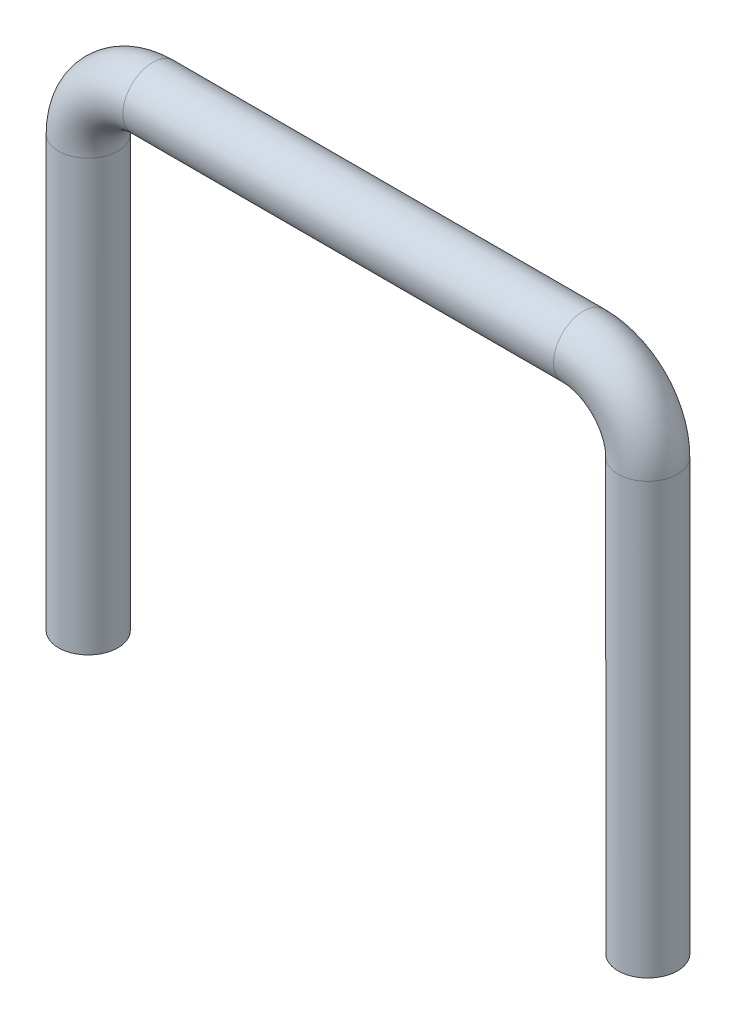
ISO-10303-21;
HEADER;
FILE_DESCRIPTION(('STEP AP214'),'2;1');
FILE_NAME('part.step','',(''),(''),'','','');
FILE_SCHEMA(('AUTOMOTIVE_DESIGN { 1 0 10303 214 1 1 1 1 }'));
ENDSEC;
DATA;
#1=APPLICATION_CONTEXT('core data for automotive mechanical design processes');
#2=APPLICATION_PROTOCOL_DEFINITION('international standard','automotive_design',2000,#1);
#3=PRODUCT_CONTEXT('',#1,'mechanical');
#4=PRODUCT('Part','Part','',(#3));
#5=PRODUCT_RELATED_PRODUCT_CATEGORY('part','',(#4));
#6=PRODUCT_DEFINITION_FORMATION('','',#4);
#7=PRODUCT_DEFINITION_CONTEXT('part definition',#1,'design');
#8=PRODUCT_DEFINITION('design','',#6,#7);
#9=PRODUCT_DEFINITION_SHAPE('','',#8);
#10=(LENGTH_UNIT() NAMED_UNIT(*) SI_UNIT(.MILLI.,.METRE.));
#11=(NAMED_UNIT(*) PLANE_ANGLE_UNIT() SI_UNIT($,.RADIAN.));
#12=(NAMED_UNIT(*) SI_UNIT($,.STERADIAN.) SOLID_ANGLE_UNIT());
#13=UNCERTAINTY_MEASURE_WITH_UNIT(LENGTH_MEASURE(1.E-05),#10,'distance_accuracy_value','');
#14=(GEOMETRIC_REPRESENTATION_CONTEXT(3) GLOBAL_UNCERTAINTY_ASSIGNED_CONTEXT((#13)) GLOBAL_UNIT_ASSIGNED_CONTEXT((#10,
#11,#12)) REPRESENTATION_CONTEXT('',''));
#15=CARTESIAN_POINT('',(0.,0.,0.));
#16=DIRECTION('',(0.,0.,1.));
#17=DIRECTION('',(1.,0.,0.));
#18=AXIS2_PLACEMENT_3D('',#15,#16,#17);
#19=CARTESIAN_POINT('',(564.55,434.,0.));
#20=DIRECTION('',(0.,-1.,0.));
#21=DIRECTION('',(1.,0.,0.));
#22=AXIS2_PLACEMENT_3D('',#19,#20,#21);
#23=CYLINDRICAL_SURFACE('',#22,30.);
#24=CARTESIAN_POINT('',(564.55,434.,0.));
#25=DIRECTION('',(0.,-1.,0.));
#26=DIRECTION('',(0.,0.,1.));
#27=AXIS2_PLACEMENT_3D('',#24,#25,#26);
#28=CIRCLE('',#27,30.);
#29=CARTESIAN_POINT('',(594.55,434.,0.));
#30=VERTEX_POINT('',#29);
#31=EDGE_CURVE('E40',#30,#30,#28,.T.);
#32=ORIENTED_EDGE('',*,*,#31,.T.);
#33=EDGE_LOOP('',(#32));
#34=FACE_BOUND('',#33,.T.);
#35=CARTESIAN_POINT('',(564.55,0.,0.));
#36=DIRECTION('',(0.,-1.,0.));
#37=DIRECTION('',(0.,0.,1.));
#38=AXIS2_PLACEMENT_3D('',#35,#36,#37);
#39=CIRCLE('',#38,30.);
#40=CARTESIAN_POINT('',(564.55,0.,30.));
#41=VERTEX_POINT('',#40);
#42=EDGE_CURVE('E10',#41,#41,#39,.T.);
#43=ORIENTED_EDGE('',*,*,#42,.F.);
#44=EDGE_LOOP('',(#43));
#45=FACE_BOUND('',#44,.T.);
#46=ADVANCED_FACE('F30',(#34,#45),#23,.T.);
#47=CARTESIAN_POINT('',(564.55,434.,0.));
#48=DIRECTION('',(0.,-1.,0.));
#49=DIRECTION('',(1.,0.,0.));
#50=AXIS2_PLACEMENT_3D('',#47,#48,#49);
#51=CYLINDRICAL_SURFACE('',#50,8.);
#52=CARTESIAN_POINT('',(564.55,434.,0.));
#53=DIRECTION('',(0.,-1.,0.));
#54=DIRECTION('',(0.,0.,1.));
#55=AXIS2_PLACEMENT_3D('',#52,#53,#54);
#56=CIRCLE('',#55,8.);
#57=CARTESIAN_POINT('',(572.55,434.,0.));
#58=VERTEX_POINT('',#57);
#59=EDGE_CURVE('E44',#58,#58,#56,.T.);
#60=ORIENTED_EDGE('',*,*,#59,.F.);
#61=EDGE_LOOP('',(#60));
#62=FACE_BOUND('',#61,.T.);
#63=CARTESIAN_POINT('',(564.55,0.,0.));
#64=DIRECTION('',(0.,-1.,0.));
#65=DIRECTION('',(0.,0.,1.));
#66=AXIS2_PLACEMENT_3D('',#63,#64,#65);
#67=CIRCLE('',#66,8.);
#68=CARTESIAN_POINT('',(564.55,0.,8.));
#69=VERTEX_POINT('',#68);
#70=EDGE_CURVE('E36',#69,#69,#67,.T.);
#71=ORIENTED_EDGE('',*,*,#70,.T.);
#72=EDGE_LOOP('',(#71));
#73=FACE_BOUND('',#72,.T.);
#74=ADVANCED_FACE('F94',(#62,#73),#51,.F.);
#75=CARTESIAN_POINT('',(499.55,434.,0.));
#76=DIRECTION('',(0.,0.,-1.));
#77=DIRECTION('',(-1.,0.,0.));
#78=AXIS2_PLACEMENT_3D('',#75,#76,#77);
#79=TOROIDAL_SURFACE('',#78,64.9999999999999,30.);
#80=CARTESIAN_POINT('',(499.55,499.,0.));
#81=DIRECTION('',(1.,0.,0.));
#82=DIRECTION('',(0.,0.,1.));
#83=AXIS2_PLACEMENT_3D('',#80,#81,#82);
#84=CIRCLE('',#83,30.);
#85=CARTESIAN_POINT('',(499.55,529.,0.));
#86=VERTEX_POINT('',#85);
#87=EDGE_CURVE('E49',#86,#86,#84,.T.);
#88=CARTESIAN_POINT('',(499.55,434.,0.));
#89=DIRECTION('',(0.,0.,-1.));
#90=DIRECTION('',(-1.,0.,0.));
#91=AXIS2_PLACEMENT_3D('',#88,#89,#90);
#92=CIRCLE('',#91,94.9999999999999);
#93=EDGE_CURVE('',#86,#30,#92,.T.);
#94=ORIENTED_EDGE('',*,*,#87,.T.);
#95=ORIENTED_EDGE('',*,*,#31,.F.);
#96=ORIENTED_EDGE('',*,*,#93,.T.);
#97=ORIENTED_EDGE('',*,*,#93,.F.);
#98=EDGE_LOOP('',(#94,#96,#95,#97));
#99=FACE_BOUND('',#98,.T.);
#100=ADVANCED_FACE('F99',(#99),#79,.T.);
#101=CARTESIAN_POINT('',(499.55,434.,0.));
#102=DIRECTION('',(0.,0.,-1.));
#103=DIRECTION('',(-1.,0.,0.));
#104=AXIS2_PLACEMENT_3D('',#101,#102,#103);
#105=TOROIDAL_SURFACE('',#104,64.9999999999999,8.);
#106=CARTESIAN_POINT('',(499.55,499.,0.));
#107=DIRECTION('',(1.,0.,0.));
#108=DIRECTION('',(0.,0.,1.));
#109=AXIS2_PLACEMENT_3D('',#106,#107,#108);
#110=CIRCLE('',#109,8.);
#111=CARTESIAN_POINT('',(499.55,507.,0.));
#112=VERTEX_POINT('',#111);
#113=EDGE_CURVE('E52',#112,#112,#110,.T.);
#114=CARTESIAN_POINT('',(499.55,434.,0.));
#115=DIRECTION('',(0.,0.,-1.));
#116=DIRECTION('',(-1.,0.,0.));
#117=AXIS2_PLACEMENT_3D('',#114,#115,#116);
#118=CIRCLE('',#117,73.);
#119=EDGE_CURVE('',#112,#58,#118,.T.);
#120=ORIENTED_EDGE('',*,*,#113,.F.);
#121=ORIENTED_EDGE('',*,*,#59,.T.);
#122=ORIENTED_EDGE('',*,*,#119,.T.);
#123=ORIENTED_EDGE('',*,*,#119,.F.);
#124=EDGE_LOOP('',(#120,#122,#121,#123));
#125=FACE_BOUND('',#124,.T.);
#126=ADVANCED_FACE('F105',(#125),#105,.F.);
#127=CARTESIAN_POINT('',(65.,499.,0.));
#128=DIRECTION('',(1.,0.,0.));
#129=DIRECTION('',(0.,0.,-1.));
#130=AXIS2_PLACEMENT_3D('',#127,#128,#129);
#131=CYLINDRICAL_SURFACE('',#130,30.);
#132=CARTESIAN_POINT('',(65.,499.,0.));
#133=DIRECTION('',(1.,0.,0.));
#134=DIRECTION('',(0.,0.,1.));
#135=AXIS2_PLACEMENT_3D('',#132,#133,#134);
#136=CIRCLE('',#135,30.);
#137=CARTESIAN_POINT('',(65.,529.,0.));
#138=VERTEX_POINT('',#137);
#139=EDGE_CURVE('E55',#138,#138,#136,.T.);
#140=ORIENTED_EDGE('',*,*,#139,.T.);
#141=EDGE_LOOP('',(#140));
#142=FACE_BOUND('',#141,.T.);
#143=ORIENTED_EDGE('',*,*,#87,.F.);
#144=EDGE_LOOP('',(#143));
#145=FACE_BOUND('',#144,.T.);
#146=ADVANCED_FACE('F111',(#142,#145),#131,.T.);
#147=CARTESIAN_POINT('',(65.,499.,0.));
#148=DIRECTION('',(1.,0.,0.));
#149=DIRECTION('',(0.,0.,-1.));
#150=AXIS2_PLACEMENT_3D('',#147,#148,#149);
#151=CYLINDRICAL_SURFACE('',#150,8.);
#152=CARTESIAN_POINT('',(65.,499.,0.));
#153=DIRECTION('',(1.,0.,0.));
#154=DIRECTION('',(0.,0.,1.));
#155=AXIS2_PLACEMENT_3D('',#152,#153,#154);
#156=CIRCLE('',#155,8.);
#157=CARTESIAN_POINT('',(65.,507.,0.));
#158=VERTEX_POINT('',#157);
#159=EDGE_CURVE('E58',#158,#158,#156,.T.);
#160=ORIENTED_EDGE('',*,*,#159,.F.);
#161=EDGE_LOOP('',(#160));
#162=FACE_BOUND('',#161,.T.);
#163=ORIENTED_EDGE('',*,*,#113,.T.);
#164=EDGE_LOOP('',(#163));
#165=FACE_BOUND('',#164,.T.);
#166=ADVANCED_FACE('F117',(#162,#165),#151,.F.);
#167=CARTESIAN_POINT('',(65.,434.,0.));
#168=DIRECTION('',(0.,0.,-1.));
#169=DIRECTION('',(-1.,0.,0.));
#170=AXIS2_PLACEMENT_3D('',#167,#168,#169);
#171=TOROIDAL_SURFACE('',#170,65.,30.);
#172=CARTESIAN_POINT('',(0.,434.,0.));
#173=DIRECTION('',(0.,1.,0.));
#174=DIRECTION('',(0.,0.,1.));
#175=AXIS2_PLACEMENT_3D('',#172,#173,#174);
#176=CIRCLE('',#175,30.);
#177=CARTESIAN_POINT('',(-30.,434.,0.));
#178=VERTEX_POINT('',#177);
#179=EDGE_CURVE('E61',#178,#178,#176,.T.);
#180=CARTESIAN_POINT('',(65.,434.,0.));
#181=DIRECTION('',(0.,0.,-1.));
#182=DIRECTION('',(-1.,0.,0.));
#183=AXIS2_PLACEMENT_3D('',#180,#181,#182);
#184=CIRCLE('',#183,95.);
#185=EDGE_CURVE('',#178,#138,#184,.T.);
#186=ORIENTED_EDGE('',*,*,#179,.T.);
#187=ORIENTED_EDGE('',*,*,#139,.F.);
#188=ORIENTED_EDGE('',*,*,#185,.T.);
#189=ORIENTED_EDGE('',*,*,#185,.F.);
#190=EDGE_LOOP('',(#186,#188,#187,#189));
#191=FACE_BOUND('',#190,.T.);
#192=ADVANCED_FACE('F90',(#191),#171,.T.);
#193=CARTESIAN_POINT('',(65.,434.,0.));
#194=DIRECTION('',(0.,0.,-1.));
#195=DIRECTION('',(-1.,0.,0.));
#196=AXIS2_PLACEMENT_3D('',#193,#194,#195);
#197=TOROIDAL_SURFACE('',#196,65.,8.);
#198=CARTESIAN_POINT('',(0.,434.,0.));
#199=DIRECTION('',(0.,1.,0.));
#200=DIRECTION('',(0.,0.,1.));
#201=AXIS2_PLACEMENT_3D('',#198,#199,#200);
#202=CIRCLE('',#201,8.);
#203=CARTESIAN_POINT('',(-7.99999999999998,434.,0.));
#204=VERTEX_POINT('',#203);
#205=EDGE_CURVE('E64',#204,#204,#202,.T.);
#206=CARTESIAN_POINT('',(65.,434.,0.));
#207=DIRECTION('',(0.,0.,-1.));
#208=DIRECTION('',(-1.,0.,0.));
#209=AXIS2_PLACEMENT_3D('',#206,#207,#208);
#210=CIRCLE('',#209,73.);
#211=EDGE_CURVE('',#204,#158,#210,.T.);
#212=ORIENTED_EDGE('',*,*,#205,.F.);
#213=ORIENTED_EDGE('',*,*,#159,.T.);
#214=ORIENTED_EDGE('',*,*,#211,.T.);
#215=ORIENTED_EDGE('',*,*,#211,.F.);
#216=EDGE_LOOP('',(#212,#214,#213,#215));
#217=FACE_BOUND('',#216,.T.);
#218=ADVANCED_FACE('F80',(#217),#197,.F.);
#219=CARTESIAN_POINT('',(0.,434.,0.));
#220=DIRECTION('',(0.,-1.,0.));
#221=DIRECTION('',(1.,0.,0.));
#222=AXIS2_PLACEMENT_3D('',#219,#220,#221);
#223=CYLINDRICAL_SURFACE('',#222,8.);
#224=ORIENTED_EDGE('',*,*,#205,.T.);
#225=EDGE_LOOP('',(#224));
#226=FACE_BOUND('',#225,.T.);
#227=CARTESIAN_POINT('',(0.,0.,0.));
#228=DIRECTION('',(0.,1.,0.));
#229=DIRECTION('',(0.,0.,1.));
#230=AXIS2_PLACEMENT_3D('',#227,#228,#229);
#231=CIRCLE('',#230,8.);
#232=CARTESIAN_POINT('',(0.,0.,8.));
#233=VERTEX_POINT('',#232);
#234=EDGE_CURVE('E70',#233,#233,#231,.T.);
#235=ORIENTED_EDGE('',*,*,#234,.F.);
#236=EDGE_LOOP('',(#235));
#237=FACE_BOUND('',#236,.T.);
#238=ADVANCED_FACE('F77',(#226,#237),#223,.F.);
#239=CARTESIAN_POINT('',(0.,434.,0.));
#240=DIRECTION('',(0.,-1.,0.));
#241=DIRECTION('',(1.,0.,0.));
#242=AXIS2_PLACEMENT_3D('',#239,#240,#241);
#243=CYLINDRICAL_SURFACE('',#242,30.);
#244=ORIENTED_EDGE('',*,*,#179,.F.);
#245=EDGE_LOOP('',(#244));
#246=FACE_BOUND('',#245,.T.);
#247=CARTESIAN_POINT('',(0.,0.,0.));
#248=DIRECTION('',(0.,1.,0.));
#249=DIRECTION('',(0.,0.,1.));
#250=AXIS2_PLACEMENT_3D('',#247,#248,#249);
#251=CIRCLE('',#250,30.);
#252=CARTESIAN_POINT('',(0.,0.,30.));
#253=VERTEX_POINT('',#252);
#254=EDGE_CURVE('E67',#253,#253,#251,.T.);
#255=ORIENTED_EDGE('',*,*,#254,.T.);
#256=EDGE_LOOP('',(#255));
#257=FACE_BOUND('',#256,.T.);
#258=ADVANCED_FACE('F79',(#246,#257),#243,.T.);
#259=CARTESIAN_POINT('',(564.55,0.,0.));
#260=DIRECTION('',(0.,-1.,0.));
#261=DIRECTION('',(0.,0.,1.));
#262=AXIS2_PLACEMENT_3D('',#259,#260,#261);
#263=PLANE('',#262);
#264=ORIENTED_EDGE('',*,*,#70,.F.);
#265=EDGE_LOOP('',(#264));
#266=FACE_BOUND('',#265,.T.);
#267=ORIENTED_EDGE('',*,*,#42,.T.);
#268=EDGE_LOOP('',(#267));
#269=FACE_BOUND('',#268,.T.);
#270=ADVANCED_FACE('F87',(#266,#269),#263,.T.);
#271=CARTESIAN_POINT('',(0.,0.,0.));
#272=DIRECTION('',(0.,1.,0.));
#273=DIRECTION('',(0.,0.,1.));
#274=AXIS2_PLACEMENT_3D('',#271,#272,#273);
#275=PLANE('',#274);
#276=ORIENTED_EDGE('',*,*,#234,.T.);
#277=EDGE_LOOP('',(#276));
#278=FACE_BOUND('',#277,.T.);
#279=ORIENTED_EDGE('',*,*,#254,.F.);
#280=EDGE_LOOP('',(#279));
#281=FACE_BOUND('',#280,.T.);
#282=ADVANCED_FACE('F74',(#278,#281),#275,.F.);
#283=CLOSED_SHELL('',(#46,#74,#100,#126,#146,#166,#192,#218,#238,#258,#270,#282));
#284=MANIFOLD_SOLID_BREP('B2',#283);
#285=ADVANCED_BREP_SHAPE_REPRESENTATION('',(#18,#284),#14);
#286=SHAPE_DEFINITION_REPRESENTATION(#9,#285);
ENDSEC;
END-ISO-10303-21;
